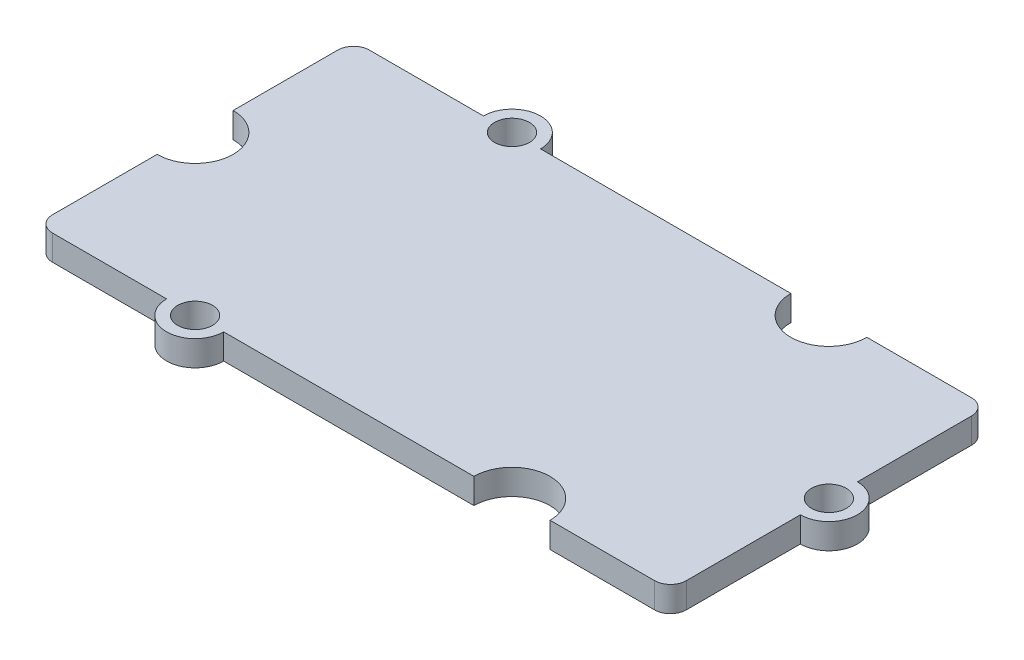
from build123d import *

# Parameters (mm, degrees)
ESQUISSE1_R        = 1.1
BOSS_EXTRU_1_DEPTH = 1.6


with BuildPart() as part:
    # Esquisse1 → Boss.-Extru.1 (new body)
    with BuildSketch(Plane(origin=(0, 0, 0), x_dir=(1, 0, 0), z_dir=(0, 1, 0))):
        with BuildLine():
            ThreePointArc((-11.8, -10), (-10, -11.8), (-8.2, -10))
            Line((-8.2, -10), (7.6, -10))
            ThreePointArc((7.6, -10), (10, -7.6), (12.4, -10))
            Line((12.4, -10), (19, -10))
            ThreePointArc((19, -10), (19.707106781, -9.707106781), (20, -9))
            Line((20, -9), (20, -1.8))
            ThreePointArc((20, -1.8), (21.8, 0), (20, 1.8))
            Line((20, 1.8), (20, 9))
            ThreePointArc((20, 9), (19.707106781, 9.707106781), (19, 10))
            Line((19, 10), (12.4, 10))
            ThreePointArc((12.4, 10), (10, 7.6), (7.6, 10))
            Line((7.6, 10), (-8.2, 10))
            ThreePointArc((-8.2, 10), (-10, 11.8), (-11.8, 10))
            Line((-11.8, 10), (-19, 10))
            ThreePointArc((-19, 10), (-19.707106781, 9.707106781), (-20, 9))
            Line((-20, 9), (-20, 2.4))
            ThreePointArc((-20, 2.4), (-17.6, 0), (-20, -2.4))
            Line((-20, -2.4), (-20, -9))
            ThreePointArc((-20, -9), (-19.707106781, -9.707106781), (-19, -10))
            Line((-19, -10), (-11.8, -10))
        make_face()
        with Locations(Location((-10, -10, 0), (0, 0, 270))):
            Circle(ESQUISSE1_R, mode=Mode.SUBTRACT)
        with Locations(Location((20, 0, 0), (0, 0, 270))):
            Circle(ESQUISSE1_R, mode=Mode.SUBTRACT)
        with Locations(Location((-10, 10, 0), (0, 0, 270))):
            Circle(ESQUISSE1_R, mode=Mode.SUBTRACT)
    extrude(amount=BOSS_EXTRU_1_DEPTH)


solid = part.part
